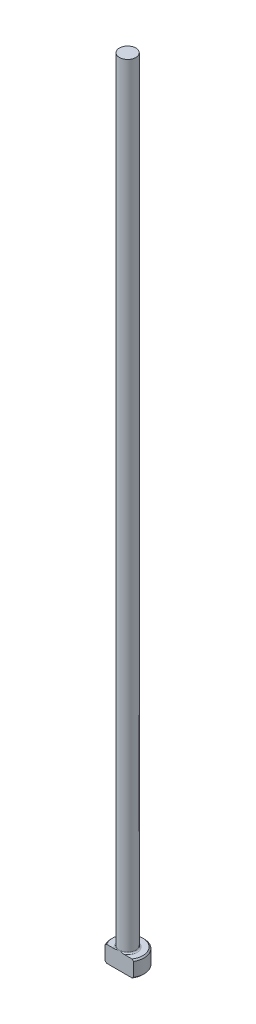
from build123d import *

# Parameters (mm, degrees)
CHAMFER1_SIZE = 0.254
FILLET1_R     = 0.254
KEY_DEPTH     = 153.466131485


with BuildPart() as part:
    # Sketch1 → Revolve1 (revolve)
    with BuildSketch(Plane.XY, mode=Mode.PRIVATE) as revolve1_sk:
        Polygon((0, 0), (-3.175, 0), (-3.175, 3.175), (-1.5875, 3.175), (-1.5875, 152.4), (0, 152.4), align=None)
    revolve(revolve1_sk.sketch.rotate(Axis((0, 259.958771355, 0), (0, -1, 0)), 270), axis=Axis((0, 259.958771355, 0), (0, -1, 0)))

    # Chamfer1
    chamfer1_edges = [part.edges().sort_by_distance(p)[0] for p in [
        (0, 3.175, -3.175),
        (0, 0, -3.175),
    ]]
    chamfer(chamfer1_edges, length=CHAMFER1_SIZE)

    # Fillet1
    fillet1_edges = [part.edges().sort_by_distance(p)[0] for p in [
        (0, 3.175, -1.5875),
    ]]
    fillet(fillet1_edges, radius=FILLET1_R)

    # Sketch2 → KEY (cut, through all)
    with BuildSketch(Plane.XZ):
        with BuildLine():
            Line((-2.749630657, 1.5875), (2.749630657, 1.5875))
            ThreePointArc((2.749630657, 1.5875), (0, 3.175), (-2.749630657, 1.5875))
        make_face()
    extrude(amount=-KEY_DEPTH, mode=Mode.SUBTRACT)


solid = part.part
